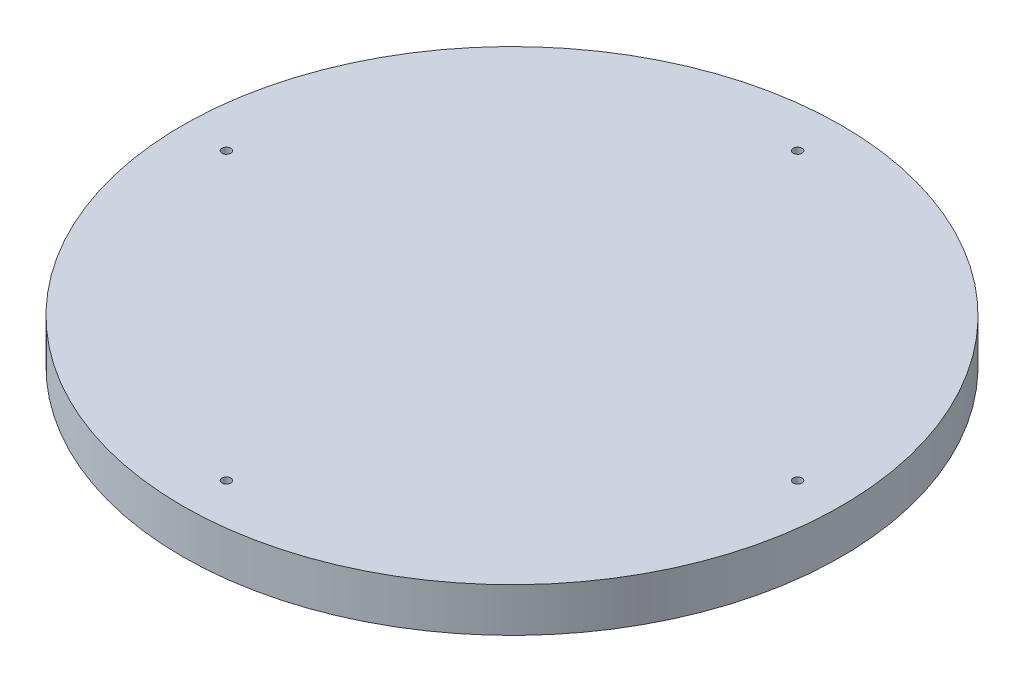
ISO-10303-21;
HEADER;
FILE_DESCRIPTION(('STEP AP214'),'2;1');
FILE_NAME('part.step','',(''),(''),'','','');
FILE_SCHEMA(('AUTOMOTIVE_DESIGN { 1 0 10303 214 1 1 1 1 }'));
ENDSEC;
DATA;
#1=APPLICATION_CONTEXT('core data for automotive mechanical design processes');
#2=APPLICATION_PROTOCOL_DEFINITION('international standard','automotive_design',2000,#1);
#3=PRODUCT_CONTEXT('',#1,'mechanical');
#4=PRODUCT('Part','Part','',(#3));
#5=PRODUCT_RELATED_PRODUCT_CATEGORY('part','',(#4));
#6=PRODUCT_DEFINITION_FORMATION('','',#4);
#7=PRODUCT_DEFINITION_CONTEXT('part definition',#1,'design');
#8=PRODUCT_DEFINITION('design','',#6,#7);
#9=PRODUCT_DEFINITION_SHAPE('','',#8);
#10=(LENGTH_UNIT() NAMED_UNIT(*) SI_UNIT(.MILLI.,.METRE.));
#11=(NAMED_UNIT(*) PLANE_ANGLE_UNIT() SI_UNIT($,.RADIAN.));
#12=(NAMED_UNIT(*) SI_UNIT($,.STERADIAN.) SOLID_ANGLE_UNIT());
#13=UNCERTAINTY_MEASURE_WITH_UNIT(LENGTH_MEASURE(1.E-05),#10,'distance_accuracy_value','');
#14=(GEOMETRIC_REPRESENTATION_CONTEXT(3) GLOBAL_UNCERTAINTY_ASSIGNED_CONTEXT((#13)) GLOBAL_UNIT_ASSIGNED_CONTEXT((#10,
#11,#12)) REPRESENTATION_CONTEXT('',''));
#15=CARTESIAN_POINT('',(0.,0.,0.));
#16=DIRECTION('',(0.,0.,1.));
#17=DIRECTION('',(1.,0.,0.));
#18=AXIS2_PLACEMENT_3D('',#15,#16,#17);
#19=CARTESIAN_POINT('',(0.,5.,0.));
#20=DIRECTION('',(0.,-1.,0.));
#21=DIRECTION('',(0.,0.,-1.));
#22=AXIS2_PLACEMENT_3D('',#19,#20,#21);
#23=CYLINDRICAL_SURFACE('',#22,37.5);
#24=CARTESIAN_POINT('',(0.,5.,0.));
#25=DIRECTION('',(0.,1.,0.));
#26=DIRECTION('',(0.,0.,1.));
#27=AXIS2_PLACEMENT_3D('',#24,#25,#26);
#28=CIRCLE('',#27,37.5);
#29=CARTESIAN_POINT('',(0.,5.,37.5));
#30=VERTEX_POINT('',#29);
#31=EDGE_CURVE('E10',#30,#30,#28,.T.);
#32=ORIENTED_EDGE('',*,*,#31,.F.);
#33=EDGE_LOOP('',(#32));
#34=FACE_BOUND('',#33,.T.);
#35=CARTESIAN_POINT('',(0.,0.,0.));
#36=DIRECTION('',(0.,1.,0.));
#37=DIRECTION('',(0.,0.,1.));
#38=AXIS2_PLACEMENT_3D('',#35,#36,#37);
#39=CIRCLE('',#38,37.5);
#40=CARTESIAN_POINT('',(0.,0.,37.5));
#41=VERTEX_POINT('',#40);
#42=EDGE_CURVE('E33',#41,#41,#39,.T.);
#43=ORIENTED_EDGE('',*,*,#42,.T.);
#44=EDGE_LOOP('',(#43));
#45=FACE_BOUND('',#44,.T.);
#46=ADVANCED_FACE('F30',(#34,#45),#23,.T.);
#47=CARTESIAN_POINT('',(0.,5.,0.));
#48=DIRECTION('',(0.,1.,0.));
#49=DIRECTION('',(0.,0.,1.));
#50=AXIS2_PLACEMENT_3D('',#47,#48,#49);
#51=PLANE('',#50);
#52=CARTESIAN_POINT('',(32.5,5.,0.));
#53=DIRECTION('',(0.,1.,0.));
#54=DIRECTION('',(0.,0.,1.));
#55=AXIS2_PLACEMENT_3D('',#52,#53,#54);
#56=CIRCLE('',#55,0.499999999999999);
#57=CARTESIAN_POINT('',(32.5,5.,0.499999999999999));
#58=VERTEX_POINT('',#57);
#59=EDGE_CURVE('E40',#58,#58,#56,.T.);
#60=ORIENTED_EDGE('',*,*,#59,.F.);
#61=EDGE_LOOP('',(#60));
#62=FACE_BOUND('',#61,.T.);
#63=CARTESIAN_POINT('',(0.,5.,32.5));
#64=DIRECTION('',(0.,1.,0.));
#65=DIRECTION('',(0.,0.,1.));
#66=AXIS2_PLACEMENT_3D('',#63,#64,#65);
#67=CIRCLE('',#66,0.5);
#68=CARTESIAN_POINT('',(0.,5.,33.));
#69=VERTEX_POINT('',#68);
#70=EDGE_CURVE('E54',#69,#69,#67,.T.);
#71=ORIENTED_EDGE('',*,*,#70,.F.);
#72=EDGE_LOOP('',(#71));
#73=FACE_BOUND('',#72,.T.);
#74=CARTESIAN_POINT('',(-32.5,5.,0.));
#75=DIRECTION('',(0.,1.,0.));
#76=DIRECTION('',(0.,0.,1.));
#77=AXIS2_PLACEMENT_3D('',#74,#75,#76);
#78=CIRCLE('',#77,0.499999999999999);
#79=CARTESIAN_POINT('',(-32.5,5.,0.499999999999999));
#80=VERTEX_POINT('',#79);
#81=EDGE_CURVE('E48',#80,#80,#78,.T.);
#82=ORIENTED_EDGE('',*,*,#81,.F.);
#83=EDGE_LOOP('',(#82));
#84=FACE_BOUND('',#83,.T.);
#85=CARTESIAN_POINT('',(0.,5.,-32.5));
#86=DIRECTION('',(0.,1.,0.));
#87=DIRECTION('',(0.,0.,1.));
#88=AXIS2_PLACEMENT_3D('',#85,#86,#87);
#89=CIRCLE('',#88,0.5);
#90=CARTESIAN_POINT('',(0.,5.,-32.));
#91=VERTEX_POINT('',#90);
#92=EDGE_CURVE('E42',#91,#91,#89,.T.);
#93=ORIENTED_EDGE('',*,*,#92,.F.);
#94=EDGE_LOOP('',(#93));
#95=FACE_BOUND('',#94,.T.);
#96=ORIENTED_EDGE('',*,*,#31,.T.);
#97=EDGE_LOOP('',(#96));
#98=FACE_BOUND('',#97,.T.);
#99=ADVANCED_FACE('F69',(#62,#73,#84,#95,#98),#51,.T.);
#100=CARTESIAN_POINT('',(0.,0.,0.));
#101=DIRECTION('',(0.,1.,0.));
#102=DIRECTION('',(0.,0.,1.));
#103=AXIS2_PLACEMENT_3D('',#100,#101,#102);
#104=PLANE('',#103);
#105=CARTESIAN_POINT('',(32.5,0.,0.));
#106=DIRECTION('',(0.,1.,0.));
#107=DIRECTION('',(0.,0.,1.));
#108=AXIS2_PLACEMENT_3D('',#105,#106,#107);
#109=CIRCLE('',#108,0.499999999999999);
#110=CARTESIAN_POINT('',(32.5,0.,0.499999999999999));
#111=VERTEX_POINT('',#110);
#112=EDGE_CURVE('E60',#111,#111,#109,.T.);
#113=ORIENTED_EDGE('',*,*,#112,.T.);
#114=EDGE_LOOP('',(#113));
#115=FACE_BOUND('',#114,.T.);
#116=CARTESIAN_POINT('',(0.,0.,32.5));
#117=DIRECTION('',(0.,1.,0.));
#118=DIRECTION('',(0.,0.,1.));
#119=AXIS2_PLACEMENT_3D('',#116,#117,#118);
#120=CIRCLE('',#119,0.5);
#121=CARTESIAN_POINT('',(0.,0.,33.));
#122=VERTEX_POINT('',#121);
#123=EDGE_CURVE('E57',#122,#122,#120,.T.);
#124=ORIENTED_EDGE('',*,*,#123,.T.);
#125=EDGE_LOOP('',(#124));
#126=FACE_BOUND('',#125,.T.);
#127=CARTESIAN_POINT('',(-32.5,0.,0.));
#128=DIRECTION('',(0.,1.,0.));
#129=DIRECTION('',(0.,0.,1.));
#130=AXIS2_PLACEMENT_3D('',#127,#128,#129);
#131=CIRCLE('',#130,0.499999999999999);
#132=CARTESIAN_POINT('',(-32.5,0.,0.499999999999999));
#133=VERTEX_POINT('',#132);
#134=EDGE_CURVE('E51',#133,#133,#131,.T.);
#135=ORIENTED_EDGE('',*,*,#134,.T.);
#136=EDGE_LOOP('',(#135));
#137=FACE_BOUND('',#136,.T.);
#138=CARTESIAN_POINT('',(0.,0.,-32.5));
#139=DIRECTION('',(0.,1.,0.));
#140=DIRECTION('',(0.,0.,1.));
#141=AXIS2_PLACEMENT_3D('',#138,#139,#140);
#142=CIRCLE('',#141,0.5);
#143=CARTESIAN_POINT('',(0.,0.,-32.));
#144=VERTEX_POINT('',#143);
#145=EDGE_CURVE('E45',#144,#144,#142,.T.);
#146=ORIENTED_EDGE('',*,*,#145,.T.);
#147=EDGE_LOOP('',(#146));
#148=FACE_BOUND('',#147,.T.);
#149=ORIENTED_EDGE('',*,*,#42,.F.);
#150=EDGE_LOOP('',(#149));
#151=FACE_BOUND('',#150,.T.);
#152=ADVANCED_FACE('F72',(#115,#126,#137,#148,#151),#104,.F.);
#153=CARTESIAN_POINT('',(0.,5.,-32.5));
#154=DIRECTION('',(0.,-1.,0.));
#155=DIRECTION('',(0.,0.,-1.));
#156=AXIS2_PLACEMENT_3D('',#153,#154,#155);
#157=CYLINDRICAL_SURFACE('',#156,0.5);
#158=ORIENTED_EDGE('',*,*,#92,.T.);
#159=EDGE_LOOP('',(#158));
#160=FACE_BOUND('',#159,.T.);
#161=ORIENTED_EDGE('',*,*,#145,.F.);
#162=EDGE_LOOP('',(#161));
#163=FACE_BOUND('',#162,.T.);
#164=ADVANCED_FACE('F80',(#160,#163),#157,.F.);
#165=CARTESIAN_POINT('',(-32.5,5.,0.));
#166=DIRECTION('',(0.,-1.,0.));
#167=DIRECTION('',(0.,0.,-1.));
#168=AXIS2_PLACEMENT_3D('',#165,#166,#167);
#169=CYLINDRICAL_SURFACE('',#168,0.499999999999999);
#170=ORIENTED_EDGE('',*,*,#81,.T.);
#171=EDGE_LOOP('',(#170));
#172=FACE_BOUND('',#171,.T.);
#173=ORIENTED_EDGE('',*,*,#134,.F.);
#174=EDGE_LOOP('',(#173));
#175=FACE_BOUND('',#174,.T.);
#176=ADVANCED_FACE('F83',(#172,#175),#169,.F.);
#177=CARTESIAN_POINT('',(0.,5.,32.5));
#178=DIRECTION('',(0.,-1.,0.));
#179=DIRECTION('',(0.,0.,-1.));
#180=AXIS2_PLACEMENT_3D('',#177,#178,#179);
#181=CYLINDRICAL_SURFACE('',#180,0.5);
#182=ORIENTED_EDGE('',*,*,#70,.T.);
#183=EDGE_LOOP('',(#182));
#184=FACE_BOUND('',#183,.T.);
#185=ORIENTED_EDGE('',*,*,#123,.F.);
#186=EDGE_LOOP('',(#185));
#187=FACE_BOUND('',#186,.T.);
#188=ADVANCED_FACE('F114',(#184,#187),#181,.F.);
#189=CARTESIAN_POINT('',(32.5,5.,0.));
#190=DIRECTION('',(0.,-1.,0.));
#191=DIRECTION('',(0.,0.,-1.));
#192=AXIS2_PLACEMENT_3D('',#189,#190,#191);
#193=CYLINDRICAL_SURFACE('',#192,0.499999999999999);
#194=ORIENTED_EDGE('',*,*,#59,.T.);
#195=EDGE_LOOP('',(#194));
#196=FACE_BOUND('',#195,.T.);
#197=ORIENTED_EDGE('',*,*,#112,.F.);
#198=EDGE_LOOP('',(#197));
#199=FACE_BOUND('',#198,.T.);
#200=ADVANCED_FACE('F66',(#196,#199),#193,.F.);
#201=CLOSED_SHELL('',(#46,#99,#152,#164,#176,#188,#200));
#202=MANIFOLD_SOLID_BREP('B2',#201);
#203=ADVANCED_BREP_SHAPE_REPRESENTATION('',(#18,#202),#14);
#204=SHAPE_DEFINITION_REPRESENTATION(#9,#203);
ENDSEC;
END-ISO-10303-21;
